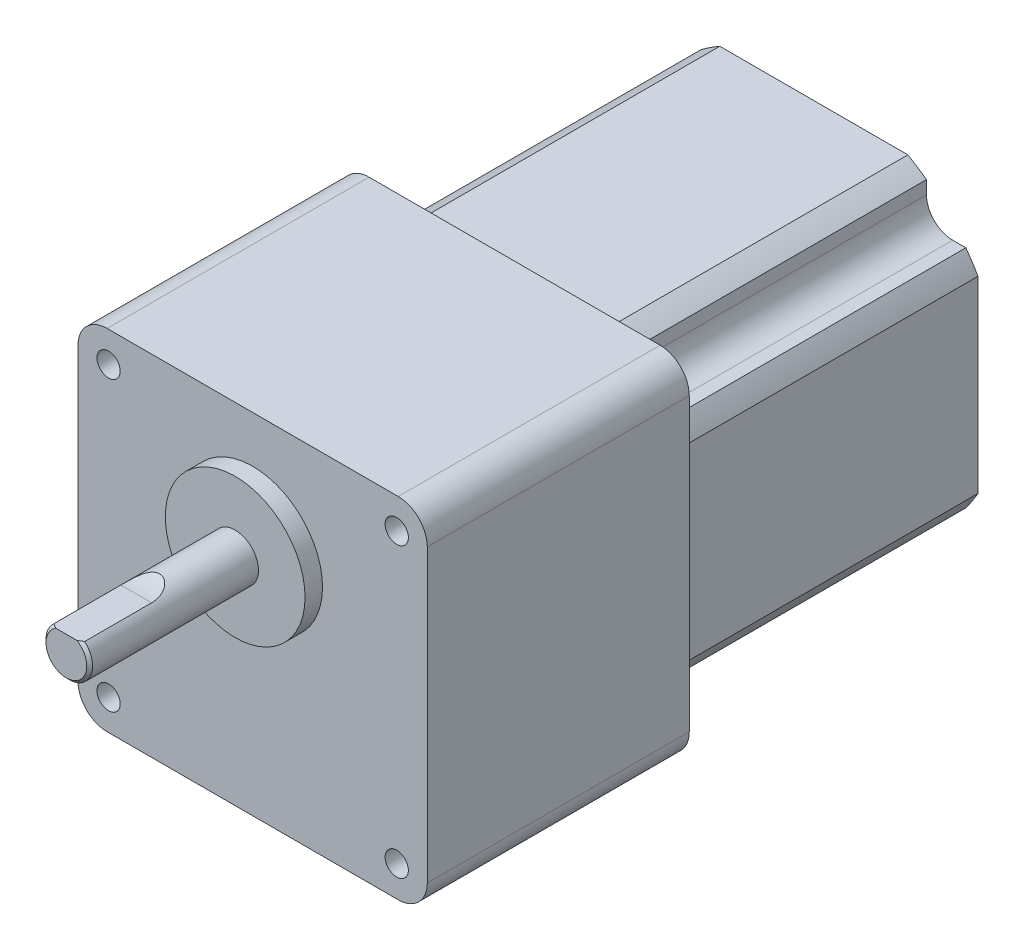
from build123d import *

# Parameters (mm, degrees)
SKETCH1_R       = 12
EXTRUDE1_DEPTH  = 3
SKETCH2_R       = 4
EXTRUDE2_DEPTH  = 29
CHAMFER1_SIZE   = 0.5
EXTRUDE3_DEPTH  = 5
EXTRUDE4_DEPTH  = 45
SKETCH6_W       = 38.7
SKETCH6_H       = 38.7
EXTRUDE6_DEPTH  = 51.4
FILLET1_R       = 4.5
SKETCH10_R      = 2
EXTRUDE10_DEPTH = 8


with BuildPart() as part:
    # Sketch1 → Extrude1 (new body)
    with BuildSketch(Plane.XY):
        Circle(SKETCH1_R)
    extrude(amount=EXTRUDE1_DEPTH)

    # Sketch2 → Extrude2 (add)
    with BuildSketch(Plane.XY.offset(3)):
        with Locations(Location((0, 0, 0), (0, 0, 180))):
            Circle(SKETCH2_R)
    extrude(amount=EXTRUDE2_DEPTH)

    # Chamfer1
    chamfer1_edges = [part.edges().sort_by_distance(p)[0] for p in [
        (4, 0, 32),
    ]]
    chamfer(chamfer1_edges, length=CHAMFER1_SIZE)

    # Sketch3 → Extrude3 (cut, symmetric)
    with BuildSketch(Plane(origin=(0, 0, 0), x_dir=(0, 0, -1), z_dir=(1, 0, 0))):
        with BuildLine():
            Line((-32, 11.5), (-32, 3))
            Line((-32, 3), (-20, 3))
            ThreePointArc((-20, 3), (-26.01040764, 5.48959236), (-28.5, 11.5))
            Line((-28.5, 11.5), (-32, 11.5))
        make_face()
        with BuildLine():
            ThreePointArc((-28.5, 11.5), (-26.01040764, 5.48959236), (-20, 3))
            Line((-20, 3), (-20, 11.5))
            Line((-20, 11.5), (-28.5, 11.5))
        make_face()
        with BuildLine():
            Line((-20, 11.5), (-20, 3))
            ThreePointArc((-20, 3), (-13.98959236, 5.48959236), (-11.5, 11.5))
            ThreePointArc((-11.5, 11.5), (-20, 20), (-28.5, 11.5))
            Line((-28.5, 11.5), (-20, 11.5))
        make_face()
        with BuildLine():
            ThreePointArc((-28.5, 11.5), (-26.01040764, 5.48959236), (-20, 3))
            Line((-20, 3), (-20, 11.5))
            Line((-20, 11.5), (-28.5, 11.5))
        make_face()
        with BuildLine():
            Line((-20, 11.5), (-20, 3))
            ThreePointArc((-20, 3), (-13.98959236, 5.48959236), (-11.5, 11.5))
            ThreePointArc((-11.5, 11.5), (-20, 20), (-28.5, 11.5))
            Line((-28.5, 11.5), (-20, 11.5))
        make_face()
    extrude(amount=EXTRUDE3_DEPTH, both=True, mode=Mode.SUBTRACT)

    # Sketch4 → Extrude4 (add)
    with BuildSketch(Plane(origin=(0, 0, 0), x_dir=(-1, 0, 0), z_dir=(0, 0, -1))):
        with BuildLine():
            Line((-25, -40), (25, -40))
            ThreePointArc((25, -40), (28.535533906, -38.535533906), (30, -35))
            Line((30, -35), (30, 15))
            ThreePointArc((30, 15), (28.535533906, 18.535533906), (25, 20))
            Line((25, 20), (-25, 20))
            ThreePointArc((-25, 20), (-28.535533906, 18.535533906), (-30, 15))
            Line((-30, 15), (-30, -35))
            ThreePointArc((-30, -35), (-28.535533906, -38.535533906), (-25, -40))
        make_face()
    extrude(amount=EXTRUDE4_DEPTH)

    # Sketch6 → Extrude6 (add)
    with BuildSketch(Plane(origin=(0, 0, -45), x_dir=(-1, 0, 0), z_dir=(0, 0, -1))):
        with BuildLine():
            Line((-26.111826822, -29.35), (-19.35, -29.35))
            Line((-19.35, -29.35), (-19.35, 9.35))
            Line((-19.35, 9.35), (-26.111826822, 9.35))
            ThreePointArc((-26.111826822, 9.35), (-27.202837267, 7.783577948), (-28.2, 6.155803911))
            Line((-28.2, 6.155803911), (-28.2, -26.155803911))
            ThreePointArc((-28.2, -26.155803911), (-27.202837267, -27.783577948), (-26.111826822, -29.35))
        make_face()
        with BuildLine():
            Line((-19.35, 9.35), (19.35, 9.35))
            Line((19.35, 9.35), (19.35, 16.111826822))
            ThreePointArc((19.35, 16.111826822), (17.783577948, 17.202837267), (16.155803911, 18.2))
            Line((16.155803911, 18.2), (-16.155803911, 18.2))
            ThreePointArc((-16.155803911, 18.2), (-17.783577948, 17.202837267), (-19.35, 16.111826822))
            Line((-19.35, 16.111826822), (-19.35, 9.35))
        make_face()
        with BuildLine():
            Line((19.35, -29.35), (26.111826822, -29.35))
            ThreePointArc((26.111826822, -29.35), (27.202837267, -27.783577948), (28.2, -26.155803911))
            Line((28.2, -26.155803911), (28.2, 6.155803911))
            ThreePointArc((28.2, 6.155803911), (27.202837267, 7.783577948), (26.111826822, 9.35))
            Line((26.111826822, 9.35), (19.35, 9.35))
            Line((19.35, 9.35), (19.35, -29.35))
        make_face()
        with BuildLine():
            Line((19.35, -36.111826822), (19.35, -29.35))
            Line((19.35, -29.35), (-19.35, -29.35))
            Line((-19.35, -29.35), (-19.35, -36.111826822))
            ThreePointArc((-19.35, -36.111826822), (-17.783577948, -37.202837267), (-16.155803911, -38.2))
            Line((-16.155803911, -38.2), (16.155803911, -38.2))
            ThreePointArc((16.155803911, -38.2), (17.783577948, -37.202837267), (19.35, -36.111826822))
        make_face()
        with Locations((0, -10)):
            Rectangle(SKETCH6_W, SKETCH6_H)
    extrude(amount=EXTRUDE6_DEPTH)

    # Fillet1
    fillet1_edges = [part.edges().sort_by_distance(p)[0] for p in [
        (19.35, 9.35, -70.7),
        (19.35, -29.35, -70.7),
        (-19.35, -29.35, -70.7),
        (-19.35, 9.35, -70.7),
    ]]
    fillet(fillet1_edges, radius=FILLET1_R)

    # Sketch10 → Extrude10 (cut)
    with BuildSketch(Plane.XY):
        with Locations((24.748737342, 14.748737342)):
            Circle(SKETCH10_R)
        with Locations((-24.748737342, 14.748737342)):
            Circle(SKETCH10_R)
        with Locations((-24.748737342, -34.748737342)):
            Circle(SKETCH10_R)
        with Locations((24.748737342, -34.748737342)):
            Circle(SKETCH10_R)
    extrude(amount=-EXTRUDE10_DEPTH, mode=Mode.SUBTRACT)


solid = part.part
